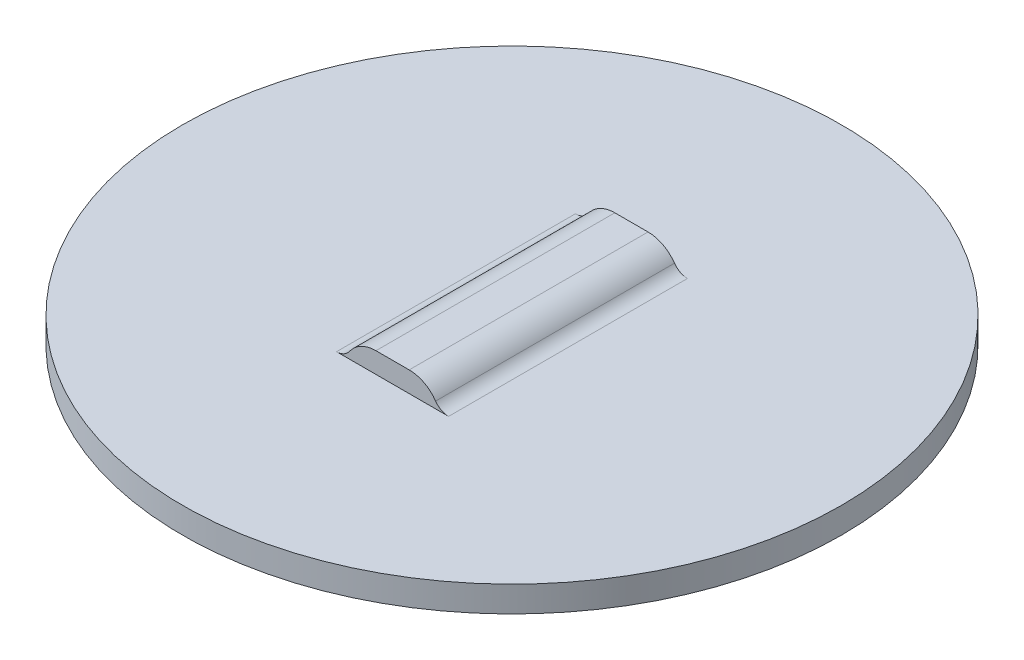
ISO-10303-21;
HEADER;
FILE_DESCRIPTION(('STEP AP214'),'2;1');
FILE_NAME('part.step','',(''),(''),'','','');
FILE_SCHEMA(('AUTOMOTIVE_DESIGN { 1 0 10303 214 1 1 1 1 }'));
ENDSEC;
DATA;
#1=APPLICATION_CONTEXT('core data for automotive mechanical design processes');
#2=APPLICATION_PROTOCOL_DEFINITION('international standard','automotive_design',2000,#1);
#3=PRODUCT_CONTEXT('',#1,'mechanical');
#4=PRODUCT('Part','Part','',(#3));
#5=PRODUCT_RELATED_PRODUCT_CATEGORY('part','',(#4));
#6=PRODUCT_DEFINITION_FORMATION('','',#4);
#7=PRODUCT_DEFINITION_CONTEXT('part definition',#1,'design');
#8=PRODUCT_DEFINITION('design','',#6,#7);
#9=PRODUCT_DEFINITION_SHAPE('','',#8);
#10=(LENGTH_UNIT() NAMED_UNIT(*) SI_UNIT(.MILLI.,.METRE.));
#11=(NAMED_UNIT(*) PLANE_ANGLE_UNIT() SI_UNIT($,.RADIAN.));
#12=(NAMED_UNIT(*) SI_UNIT($,.STERADIAN.) SOLID_ANGLE_UNIT());
#13=UNCERTAINTY_MEASURE_WITH_UNIT(LENGTH_MEASURE(1.E-05),#10,'distance_accuracy_value','');
#14=(GEOMETRIC_REPRESENTATION_CONTEXT(3) GLOBAL_UNCERTAINTY_ASSIGNED_CONTEXT((#13)) GLOBAL_UNIT_ASSIGNED_CONTEXT((#10,
#11,#12)) REPRESENTATION_CONTEXT('',''));
#15=CARTESIAN_POINT('',(0.,0.,0.));
#16=DIRECTION('',(0.,0.,1.));
#17=DIRECTION('',(1.,0.,0.));
#18=AXIS2_PLACEMENT_3D('',#15,#16,#17);
#19=CARTESIAN_POINT('',(-0.8001,-0.562707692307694,11.5062));
#20=DIRECTION('',(0.,0.,-1.));
#21=DIRECTION('',(-1.,0.,0.));
#22=AXIS2_PLACEMENT_3D('',#19,#20,#21);
#23=CYLINDRICAL_SURFACE('',#22,0.308707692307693);
#24=DIRECTION('',(0.,0.,1.));
#25=VECTOR('',#24,1.);
#26=CARTESIAN_POINT('',(-0.8001,-0.254,11.5062));
#27=LINE('',#26,#25);
#28=CARTESIAN_POINT('',(-0.8001,-0.254,11.5062));
#29=VERTEX_POINT('',#28);
#30=CARTESIAN_POINT('',(-0.8001,-0.254,0.));
#31=VERTEX_POINT('',#30);
#32=EDGE_CURVE('E129',#29,#31,#27,.F.);
#33=ORIENTED_EDGE('',*,*,#32,.F.);
#34=CARTESIAN_POINT('',(-0.8001,-0.562707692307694,11.5062));
#35=DIRECTION('',(0.,0.,-1.));
#36=DIRECTION('',(-1.,0.,0.));
#37=AXIS2_PLACEMENT_3D('',#34,#35,#36);
#38=CIRCLE('',#37,0.308707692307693);
#39=CARTESIAN_POINT('',(-1.05328589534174,-0.38608,11.5062));
#40=VERTEX_POINT('',#39);
#41=EDGE_CURVE('E119',#40,#29,#38,.T.);
#42=ORIENTED_EDGE('',*,*,#41,.F.);
#43=DIRECTION('',(0.,0.,-1.));
#44=VECTOR('',#43,1.);
#45=CARTESIAN_POINT('',(-1.05328589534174,-0.38608,11.5062));
#46=LINE('',#45,#44);
#47=CARTESIAN_POINT('',(-1.05328589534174,-0.38608,0.));
#48=VERTEX_POINT('',#47);
#49=EDGE_CURVE('E113',#48,#40,#46,.F.);
#50=ORIENTED_EDGE('',*,*,#49,.F.);
#51=CARTESIAN_POINT('',(-0.8001,-0.562707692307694,0.));
#52=DIRECTION('',(0.,0.,-1.));
#53=DIRECTION('',(-1.,0.,0.));
#54=AXIS2_PLACEMENT_3D('',#51,#52,#53);
#55=CIRCLE('',#54,0.308707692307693);
#56=EDGE_CURVE('E21',#48,#31,#55,.T.);
#57=ORIENTED_EDGE('',*,*,#56,.T.);
#58=EDGE_LOOP('',(#33,#42,#50,#57));
#59=FACE_BOUND('',#58,.T.);
#60=ADVANCED_FACE('F18',(#59),#23,.F.);
#61=CARTESIAN_POINT('',(-0.8001,-0.254,11.5062));
#62=DIRECTION('',(0.,-1.,0.));
#63=DIRECTION('',(1.,0.,0.));
#64=AXIS2_PLACEMENT_3D('',#61,#62,#63);
#65=PLANE('',#64);
#66=DIRECTION('',(-1.,0.,0.));
#67=VECTOR('',#66,1.);
#68=CARTESIAN_POINT('',(-2.69899421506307,-0.254,11.5062));
#69=LINE('',#68,#67);
#70=CARTESIAN_POINT('',(0.8001,-0.254,11.5062));
#71=VERTEX_POINT('',#70);
#72=EDGE_CURVE('E121',#29,#71,#69,.F.);
#73=ORIENTED_EDGE('',*,*,#72,.F.);
#74=ORIENTED_EDGE('',*,*,#32,.T.);
#75=DIRECTION('',(-1.,0.,0.));
#76=VECTOR('',#75,1.);
#77=CARTESIAN_POINT('',(-15.875,-0.254,0.));
#78=LINE('',#77,#76);
#79=CARTESIAN_POINT('',(0.8001,-0.254,0.));
#80=VERTEX_POINT('',#79);
#81=EDGE_CURVE('E105',#31,#80,#78,.F.);
#82=ORIENTED_EDGE('',*,*,#81,.T.);
#83=DIRECTION('',(0.,0.,-1.));
#84=VECTOR('',#83,1.);
#85=CARTESIAN_POINT('',(0.8001,-0.254,11.5062));
#86=LINE('',#85,#84);
#87=EDGE_CURVE('E109',#80,#71,#86,.F.);
#88=ORIENTED_EDGE('',*,*,#87,.T.);
#89=EDGE_LOOP('',(#73,#74,#82,#88));
#90=FACE_BOUND('',#89,.T.);
#91=ADVANCED_FACE('F365',(#90),#65,.T.);
#92=CARTESIAN_POINT('',(0.8001,-0.562707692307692,11.5062));
#93=DIRECTION('',(0.,0.,-1.));
#94=DIRECTION('',(-1.,0.,0.));
#95=AXIS2_PLACEMENT_3D('',#92,#93,#94);
#96=CYLINDRICAL_SURFACE('',#95,0.308707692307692);
#97=ORIENTED_EDGE('',*,*,#87,.F.);
#98=CARTESIAN_POINT('',(0.8001,-0.562707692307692,0.));
#99=DIRECTION('',(0.,0.,-1.));
#100=DIRECTION('',(-1.,0.,0.));
#101=AXIS2_PLACEMENT_3D('',#98,#99,#100);
#102=CIRCLE('',#101,0.308707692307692);
#103=CARTESIAN_POINT('',(1.05328589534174,-0.386080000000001,0.));
#104=VERTEX_POINT('',#103);
#105=EDGE_CURVE('E116',#80,#104,#102,.T.);
#106=ORIENTED_EDGE('',*,*,#105,.T.);
#107=DIRECTION('',(0.,0.,-1.));
#108=VECTOR('',#107,1.);
#109=CARTESIAN_POINT('',(1.05328589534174,-0.386080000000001,11.5062));
#110=LINE('',#109,#108);
#111=CARTESIAN_POINT('',(1.05328589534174,-0.386080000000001,11.5062));
#112=VERTEX_POINT('',#111);
#113=EDGE_CURVE('E125',#112,#104,#110,.T.);
#114=ORIENTED_EDGE('',*,*,#113,.F.);
#115=CARTESIAN_POINT('',(0.8001,-0.562707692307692,11.5062));
#116=DIRECTION('',(0.,0.,-1.));
#117=DIRECTION('',(-1.,0.,0.));
#118=AXIS2_PLACEMENT_3D('',#115,#116,#117);
#119=CIRCLE('',#118,0.308707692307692);
#120=EDGE_CURVE('E170',#71,#112,#119,.T.);
#121=ORIENTED_EDGE('',*,*,#120,.F.);
#122=EDGE_LOOP('',(#97,#106,#114,#121));
#123=FACE_BOUND('',#122,.T.);
#124=ADVANCED_FACE('F357',(#123),#96,.F.);
#125=CARTESIAN_POINT('',(-15.875,0.,0.));
#126=DIRECTION('',(0.,0.,-1.));
#127=DIRECTION('',(-1.,0.,0.));
#128=AXIS2_PLACEMENT_3D('',#125,#126,#127);
#129=PLANE('',#128);
#130=ORIENTED_EDGE('',*,*,#81,.F.);
#131=ORIENTED_EDGE('',*,*,#56,.F.);
#132=CARTESIAN_POINT('',(-2.69899421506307,0.762,0.));
#133=DIRECTION('',(0.,0.,-1.));
#134=DIRECTION('',(-1.,0.,0.));
#135=AXIS2_PLACEMENT_3D('',#132,#133,#134);
#136=CIRCLE('',#135,2.0066);
#137=CARTESIAN_POINT('',(-2.69899421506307,-1.2446,0.));
#138=VERTEX_POINT('',#137);
#139=EDGE_CURVE('E101',#138,#48,#136,.F.);
#140=ORIENTED_EDGE('',*,*,#139,.F.);
#141=DIRECTION('',(1.,0.,0.));
#142=VECTOR('',#141,1.);
#143=CARTESIAN_POINT('',(2.2479,-1.2446,0.));
#144=LINE('',#143,#142);
#145=CARTESIAN_POINT('',(2.69899421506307,-1.2446,0.));
#146=VERTEX_POINT('',#145);
#147=EDGE_CURVE('E177',#146,#138,#144,.F.);
#148=ORIENTED_EDGE('',*,*,#147,.F.);
#149=CARTESIAN_POINT('',(2.69899421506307,0.761999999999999,0.));
#150=DIRECTION('',(0.,0.,-1.));
#151=DIRECTION('',(-1.,0.,0.));
#152=AXIS2_PLACEMENT_3D('',#149,#150,#151);
#153=CIRCLE('',#152,2.0066);
#154=EDGE_CURVE('E162',#104,#146,#153,.F.);
#155=ORIENTED_EDGE('',*,*,#154,.F.);
#156=ORIENTED_EDGE('',*,*,#105,.F.);
#157=EDGE_LOOP('',(#130,#131,#140,#148,#155,#156));
#158=FACE_BOUND('',#157,.T.);
#159=ADVANCED_FACE('F99',(#158),#129,.F.);
#160=CARTESIAN_POINT('',(-2.69899421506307,0.762,11.5062));
#161=DIRECTION('',(0.,0.,-1.));
#162=DIRECTION('',(-1.,0.,0.));
#163=AXIS2_PLACEMENT_3D('',#160,#161,#162);
#164=CYLINDRICAL_SURFACE('',#163,2.0066);
#165=ORIENTED_EDGE('',*,*,#139,.T.);
#166=ORIENTED_EDGE('',*,*,#49,.T.);
#167=CARTESIAN_POINT('',(-2.69899421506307,0.762,11.5062));
#168=DIRECTION('',(0.,0.,-1.));
#169=DIRECTION('',(-1.,0.,0.));
#170=AXIS2_PLACEMENT_3D('',#167,#168,#169);
#171=CIRCLE('',#170,2.0066);
#172=CARTESIAN_POINT('',(-2.69899421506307,-1.2446,11.5062));
#173=VERTEX_POINT('',#172);
#174=EDGE_CURVE('E168',#173,#40,#171,.F.);
#175=ORIENTED_EDGE('',*,*,#174,.F.);
#176=DIRECTION('',(0.,0.,1.));
#177=VECTOR('',#176,1.);
#178=CARTESIAN_POINT('',(-2.69899421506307,-1.2446,11.5062));
#179=LINE('',#178,#177);
#180=EDGE_CURVE('E115',#138,#173,#179,.T.);
#181=ORIENTED_EDGE('',*,*,#180,.F.);
#182=EDGE_LOOP('',(#165,#166,#175,#181));
#183=FACE_BOUND('',#182,.T.);
#184=ADVANCED_FACE('F111',(#183),#164,.T.);
#185=CARTESIAN_POINT('',(-2.69899421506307,0.,11.5062));
#186=DIRECTION('',(0.,0.,-1.));
#187=DIRECTION('',(-1.,0.,0.));
#188=AXIS2_PLACEMENT_3D('',#185,#186,#187);
#189=PLANE('',#188);
#190=DIRECTION('',(1.,0.,0.));
#191=VECTOR('',#190,1.);
#192=CARTESIAN_POINT('',(2.2479,-1.2446,11.5062));
#193=LINE('',#192,#191);
#194=CARTESIAN_POINT('',(2.69899421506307,-1.2446,11.5062));
#195=VERTEX_POINT('',#194);
#196=EDGE_CURVE('E183',#173,#195,#193,.T.);
#197=ORIENTED_EDGE('',*,*,#196,.F.);
#198=ORIENTED_EDGE('',*,*,#174,.T.);
#199=ORIENTED_EDGE('',*,*,#41,.T.);
#200=ORIENTED_EDGE('',*,*,#72,.T.);
#201=ORIENTED_EDGE('',*,*,#120,.T.);
#202=CARTESIAN_POINT('',(2.69899421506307,0.761999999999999,11.5062));
#203=DIRECTION('',(0.,0.,-1.));
#204=DIRECTION('',(-1.,0.,0.));
#205=AXIS2_PLACEMENT_3D('',#202,#203,#204);
#206=CIRCLE('',#205,2.0066);
#207=EDGE_CURVE('E165',#195,#112,#206,.T.);
#208=ORIENTED_EDGE('',*,*,#207,.F.);
#209=EDGE_LOOP('',(#197,#198,#199,#200,#201,#208));
#210=FACE_BOUND('',#209,.T.);
#211=ADVANCED_FACE('F333',(#210),#189,.T.);
#212=CARTESIAN_POINT('',(2.69899421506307,0.761999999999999,11.5062));
#213=DIRECTION('',(0.,0.,-1.));
#214=DIRECTION('',(-1.,0.,0.));
#215=AXIS2_PLACEMENT_3D('',#212,#213,#214);
#216=CYLINDRICAL_SURFACE('',#215,2.0066);
#217=ORIENTED_EDGE('',*,*,#154,.T.);
#218=DIRECTION('',(0.,0.,1.));
#219=VECTOR('',#218,1.);
#220=CARTESIAN_POINT('',(2.69899421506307,-1.2446,11.5062));
#221=LINE('',#220,#219);
#222=EDGE_CURVE('E180',#195,#146,#221,.F.);
#223=ORIENTED_EDGE('',*,*,#222,.F.);
#224=ORIENTED_EDGE('',*,*,#207,.T.);
#225=ORIENTED_EDGE('',*,*,#113,.T.);
#226=EDGE_LOOP('',(#217,#223,#224,#225));
#227=FACE_BOUND('',#226,.T.);
#228=ADVANCED_FACE('F325',(#227),#216,.T.);
#229=CARTESIAN_POINT('',(0.8001,-0.562707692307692,11.5062));
#230=DIRECTION('',(0.,0.,-1.));
#231=DIRECTION('',(-1.,0.,0.));
#232=AXIS2_PLACEMENT_3D('',#229,#230,#231);
#233=CYLINDRICAL_SURFACE('',#232,1.55330769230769);
#234=CARTESIAN_POINT('',(0.8001,-0.562707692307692,0.));
#235=DIRECTION('',(0.,0.,-1.));
#236=DIRECTION('',(-1.,0.,0.));
#237=AXIS2_PLACEMENT_3D('',#234,#235,#236);
#238=CIRCLE('',#237,1.55330769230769);
#239=CARTESIAN_POINT('',(2.07404168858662,0.326020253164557,0.));
#240=VERTEX_POINT('',#239);
#241=CARTESIAN_POINT('',(0.8001,0.9906,0.));
#242=VERTEX_POINT('',#241);
#243=EDGE_CURVE('E143',#240,#242,#238,.F.);
#244=ORIENTED_EDGE('',*,*,#243,.T.);
#245=DIRECTION('',(0.,0.,1.));
#246=VECTOR('',#245,1.);
#247=CARTESIAN_POINT('',(0.8001,0.9906,11.5062));
#248=LINE('',#247,#246);
#249=CARTESIAN_POINT('',(0.8001,0.9906,11.5062));
#250=VERTEX_POINT('',#249);
#251=EDGE_CURVE('E164',#242,#250,#248,.T.);
#252=ORIENTED_EDGE('',*,*,#251,.T.);
#253=CARTESIAN_POINT('',(0.8001,-0.562707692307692,11.5062));
#254=DIRECTION('',(0.,0.,-1.));
#255=DIRECTION('',(-1.,0.,0.));
#256=AXIS2_PLACEMENT_3D('',#253,#254,#255);
#257=CIRCLE('',#256,1.55330769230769);
#258=CARTESIAN_POINT('',(2.07404168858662,0.326020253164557,11.5062));
#259=VERTEX_POINT('',#258);
#260=EDGE_CURVE('E151',#250,#259,#257,.T.);
#261=ORIENTED_EDGE('',*,*,#260,.T.);
#262=DIRECTION('',(0.,0.,-1.));
#263=VECTOR('',#262,1.);
#264=CARTESIAN_POINT('',(2.07404168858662,0.326020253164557,11.5062));
#265=LINE('',#264,#263);
#266=EDGE_CURVE('E150',#259,#240,#265,.T.);
#267=ORIENTED_EDGE('',*,*,#266,.T.);
#268=EDGE_LOOP('',(#244,#252,#261,#267));
#269=FACE_BOUND('',#268,.T.);
#270=ADVANCED_FACE('F216',(#269),#233,.T.);
#271=CARTESIAN_POINT('',(-0.8001,0.9906,11.5062));
#272=DIRECTION('',(0.,-1.,0.));
#273=DIRECTION('',(1.,0.,0.));
#274=AXIS2_PLACEMENT_3D('',#271,#272,#273);
#275=PLANE('',#274);
#276=DIRECTION('',(0.,0.,-1.));
#277=VECTOR('',#276,1.);
#278=CARTESIAN_POINT('',(-0.8001,0.9906,11.5062));
#279=LINE('',#278,#277);
#280=CARTESIAN_POINT('',(-0.8001,0.9906,11.5062));
#281=VERTEX_POINT('',#280);
#282=CARTESIAN_POINT('',(-0.8001,0.9906,0.));
#283=VERTEX_POINT('',#282);
#284=EDGE_CURVE('E179',#281,#283,#279,.T.);
#285=ORIENTED_EDGE('',*,*,#284,.F.);
#286=DIRECTION('',(-1.,0.,0.));
#287=VECTOR('',#286,1.);
#288=CARTESIAN_POINT('',(-0.8001,0.9906,11.5062));
#289=LINE('',#288,#287);
#290=EDGE_CURVE('E154',#281,#250,#289,.F.);
#291=ORIENTED_EDGE('',*,*,#290,.T.);
#292=ORIENTED_EDGE('',*,*,#251,.F.);
#293=DIRECTION('',(1.,0.,0.));
#294=VECTOR('',#293,1.);
#295=CARTESIAN_POINT('',(-2.69899421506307,0.9906,0.));
#296=LINE('',#295,#294);
#297=EDGE_CURVE('E142',#242,#283,#296,.F.);
#298=ORIENTED_EDGE('',*,*,#297,.T.);
#299=EDGE_LOOP('',(#285,#291,#292,#298));
#300=FACE_BOUND('',#299,.T.);
#301=ADVANCED_FACE('F208',(#300),#275,.F.);
#302=CARTESIAN_POINT('',(-0.8001,-0.562707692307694,11.5062));
#303=DIRECTION('',(0.,0.,-1.));
#304=DIRECTION('',(-1.,0.,0.));
#305=AXIS2_PLACEMENT_3D('',#302,#303,#304);
#306=CYLINDRICAL_SURFACE('',#305,1.55330769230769);
#307=CARTESIAN_POINT('',(-0.8001,-0.562707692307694,11.5062));
#308=DIRECTION('',(0.,0.,-1.));
#309=DIRECTION('',(-1.,0.,0.));
#310=AXIS2_PLACEMENT_3D('',#307,#308,#309);
#311=CIRCLE('',#310,1.55330769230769);
#312=CARTESIAN_POINT('',(-2.07404168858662,0.326020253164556,11.5062));
#313=VERTEX_POINT('',#312);
#314=EDGE_CURVE('E155',#313,#281,#311,.T.);
#315=ORIENTED_EDGE('',*,*,#314,.T.);
#316=ORIENTED_EDGE('',*,*,#284,.T.);
#317=CARTESIAN_POINT('',(-0.8001,-0.562707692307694,0.));
#318=DIRECTION('',(0.,0.,-1.));
#319=DIRECTION('',(-1.,0.,0.));
#320=AXIS2_PLACEMENT_3D('',#317,#318,#319);
#321=CIRCLE('',#320,1.55330769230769);
#322=CARTESIAN_POINT('',(-2.07404168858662,0.326020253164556,0.));
#323=VERTEX_POINT('',#322);
#324=EDGE_CURVE('E139',#283,#323,#321,.F.);
#325=ORIENTED_EDGE('',*,*,#324,.T.);
#326=DIRECTION('',(0.,0.,-1.));
#327=VECTOR('',#326,1.);
#328=CARTESIAN_POINT('',(-2.07404168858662,0.326020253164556,11.5062));
#329=LINE('',#328,#327);
#330=EDGE_CURVE('E161',#323,#313,#329,.F.);
#331=ORIENTED_EDGE('',*,*,#330,.T.);
#332=EDGE_LOOP('',(#315,#316,#325,#331));
#333=FACE_BOUND('',#332,.T.);
#334=ADVANCED_FACE('F233',(#333),#306,.T.);
#335=CARTESIAN_POINT('',(2.2479,-1.2446,11.5062));
#336=DIRECTION('',(0.,-1.,0.));
#337=DIRECTION('',(1.,0.,0.));
#338=AXIS2_PLACEMENT_3D('',#335,#336,#337);
#339=PLANE('',#338);
#340=CARTESIAN_POINT('',(0.,-1.2446,5.7531));
#341=DIRECTION('',(0.,-1.,0.));
#342=DIRECTION('',(1.,0.,0.));
#343=AXIS2_PLACEMENT_3D('',#340,#341,#342);
#344=CIRCLE('',#343,15.875);
#345=CARTESIAN_POINT('',(15.875,-1.2446,5.7531));
#346=VERTEX_POINT('',#345);
#347=EDGE_CURVE('E132',#346,#346,#344,.F.);
#348=ORIENTED_EDGE('',*,*,#347,.F.);
#349=EDGE_LOOP('',(#348));
#350=FACE_BOUND('',#349,.T.);
#351=ORIENTED_EDGE('',*,*,#196,.T.);
#352=ORIENTED_EDGE('',*,*,#222,.T.);
#353=ORIENTED_EDGE('',*,*,#147,.T.);
#354=ORIENTED_EDGE('',*,*,#180,.T.);
#355=EDGE_LOOP('',(#351,#352,#353,#354));
#356=FACE_BOUND('',#355,.T.);
#357=ADVANCED_FACE('F235',(#350,#356),#339,.T.);
#358=CARTESIAN_POINT('',(-2.69899421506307,0.762,11.5062));
#359=DIRECTION('',(0.,0.,-1.));
#360=DIRECTION('',(-1.,0.,0.));
#361=AXIS2_PLACEMENT_3D('',#358,#359,#360);
#362=CYLINDRICAL_SURFACE('',#361,0.762);
#363=ORIENTED_EDGE('',*,*,#330,.F.);
#364=CARTESIAN_POINT('',(-2.69899421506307,0.762,0.));
#365=DIRECTION('',(0.,0.,-1.));
#366=DIRECTION('',(-1.,0.,0.));
#367=AXIS2_PLACEMENT_3D('',#364,#365,#366);
#368=CIRCLE('',#367,0.762);
#369=CARTESIAN_POINT('',(-2.69899421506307,0.,0.));
#370=VERTEX_POINT('',#369);
#371=EDGE_CURVE('E136',#323,#370,#368,.T.);
#372=ORIENTED_EDGE('',*,*,#371,.T.);
#373=DIRECTION('',(0.,0.,1.));
#374=VECTOR('',#373,1.);
#375=CARTESIAN_POINT('',(-2.69899421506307,0.,11.5062));
#376=LINE('',#375,#374);
#377=CARTESIAN_POINT('',(-2.69899421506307,0.,11.5062));
#378=VERTEX_POINT('',#377);
#379=EDGE_CURVE('E135',#370,#378,#376,.T.);
#380=ORIENTED_EDGE('',*,*,#379,.T.);
#381=CARTESIAN_POINT('',(-2.69899421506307,0.762,11.5062));
#382=DIRECTION('',(0.,0.,-1.));
#383=DIRECTION('',(-1.,0.,0.));
#384=AXIS2_PLACEMENT_3D('',#381,#382,#383);
#385=CIRCLE('',#384,0.762);
#386=EDGE_CURVE('E158',#378,#313,#385,.F.);
#387=ORIENTED_EDGE('',*,*,#386,.T.);
#388=EDGE_LOOP('',(#363,#372,#380,#387));
#389=FACE_BOUND('',#388,.T.);
#390=ADVANCED_FACE('F230',(#389),#362,.F.);
#391=CARTESIAN_POINT('',(-0.8001,-0.562707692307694,11.5062));
#392=DIRECTION('',(0.,0.,-1.));
#393=DIRECTION('',(-1.,0.,0.));
#394=AXIS2_PLACEMENT_3D('',#391,#392,#393);
#395=PLANE('',#394);
#396=CARTESIAN_POINT('',(2.69899421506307,0.761999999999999,11.5062));
#397=DIRECTION('',(0.,0.,-1.));
#398=DIRECTION('',(-1.,0.,0.));
#399=AXIS2_PLACEMENT_3D('',#396,#397,#398);
#400=CIRCLE('',#399,0.762);
#401=CARTESIAN_POINT('',(2.69899421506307,0.,11.5062));
#402=VERTEX_POINT('',#401);
#403=EDGE_CURVE('E147',#402,#259,#400,.T.);
#404=ORIENTED_EDGE('',*,*,#403,.T.);
#405=ORIENTED_EDGE('',*,*,#260,.F.);
#406=ORIENTED_EDGE('',*,*,#290,.F.);
#407=ORIENTED_EDGE('',*,*,#314,.F.);
#408=ORIENTED_EDGE('',*,*,#386,.F.);
#409=DIRECTION('',(1.,0.,0.));
#410=VECTOR('',#409,1.);
#411=CARTESIAN_POINT('',(2.2479,0.,11.5062));
#412=LINE('',#411,#410);
#413=EDGE_CURVE('E194',#378,#402,#412,.T.);
#414=ORIENTED_EDGE('',*,*,#413,.T.);
#415=EDGE_LOOP('',(#404,#405,#406,#407,#408,#414));
#416=FACE_BOUND('',#415,.T.);
#417=ADVANCED_FACE('F226',(#416),#395,.F.);
#418=CARTESIAN_POINT('',(2.69899421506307,0.761999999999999,11.5062));
#419=DIRECTION('',(0.,0.,-1.));
#420=DIRECTION('',(-1.,0.,0.));
#421=AXIS2_PLACEMENT_3D('',#418,#419,#420);
#422=CYLINDRICAL_SURFACE('',#421,0.762);
#423=DIRECTION('',(0.,0.,1.));
#424=VECTOR('',#423,1.);
#425=CARTESIAN_POINT('',(2.69899421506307,0.,11.5062));
#426=LINE('',#425,#424);
#427=CARTESIAN_POINT('',(2.69899421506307,0.,0.));
#428=VERTEX_POINT('',#427);
#429=EDGE_CURVE('E197',#402,#428,#426,.F.);
#430=ORIENTED_EDGE('',*,*,#429,.T.);
#431=CARTESIAN_POINT('',(2.69899421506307,0.761999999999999,0.));
#432=DIRECTION('',(0.,0.,-1.));
#433=DIRECTION('',(-1.,0.,0.));
#434=AXIS2_PLACEMENT_3D('',#431,#432,#433);
#435=CIRCLE('',#434,0.762);
#436=EDGE_CURVE('E36',#428,#240,#435,.T.);
#437=ORIENTED_EDGE('',*,*,#436,.T.);
#438=ORIENTED_EDGE('',*,*,#266,.F.);
#439=ORIENTED_EDGE('',*,*,#403,.F.);
#440=EDGE_LOOP('',(#430,#437,#438,#439));
#441=FACE_BOUND('',#440,.T.);
#442=ADVANCED_FACE('F219',(#441),#422,.F.);
#443=CARTESIAN_POINT('',(-2.69899421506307,0.762,0.));
#444=DIRECTION('',(0.,0.,1.));
#445=DIRECTION('',(1.,0.,0.));
#446=AXIS2_PLACEMENT_3D('',#443,#444,#445);
#447=PLANE('',#446);
#448=ORIENTED_EDGE('',*,*,#371,.F.);
#449=ORIENTED_EDGE('',*,*,#324,.F.);
#450=ORIENTED_EDGE('',*,*,#297,.F.);
#451=ORIENTED_EDGE('',*,*,#243,.F.);
#452=ORIENTED_EDGE('',*,*,#436,.F.);
#453=DIRECTION('',(1.,0.,0.));
#454=VECTOR('',#453,1.);
#455=CARTESIAN_POINT('',(2.2479,0.,0.));
#456=LINE('',#455,#454);
#457=EDGE_CURVE('E27',#428,#370,#456,.F.);
#458=ORIENTED_EDGE('',*,*,#457,.T.);
#459=EDGE_LOOP('',(#448,#449,#450,#451,#452,#458));
#460=FACE_BOUND('',#459,.T.);
#461=ADVANCED_FACE('F214',(#460),#447,.F.);
#462=CARTESIAN_POINT('',(0.,0.,5.7531));
#463=DIRECTION('',(0.,-1.,0.));
#464=DIRECTION('',(1.,0.,0.));
#465=AXIS2_PLACEMENT_3D('',#462,#463,#464);
#466=CYLINDRICAL_SURFACE('',#465,15.875);
#467=ORIENTED_EDGE('',*,*,#347,.T.);
#468=EDGE_LOOP('',(#467));
#469=FACE_BOUND('',#468,.T.);
#470=CARTESIAN_POINT('',(0.,0.,5.7531));
#471=DIRECTION('',(0.,-1.,0.));
#472=DIRECTION('',(1.,0.,0.));
#473=AXIS2_PLACEMENT_3D('',#470,#471,#472);
#474=CIRCLE('',#473,15.875);
#475=CARTESIAN_POINT('',(15.875,0.,5.7531));
#476=VERTEX_POINT('',#475);
#477=EDGE_CURVE('E11',#476,#476,#474,.T.);
#478=ORIENTED_EDGE('',*,*,#477,.T.);
#479=EDGE_LOOP('',(#478));
#480=FACE_BOUND('',#479,.T.);
#481=ADVANCED_FACE('F246',(#469,#480),#466,.T.);
#482=CARTESIAN_POINT('',(2.2479,0.,11.5062));
#483=DIRECTION('',(0.,-1.,0.));
#484=DIRECTION('',(1.,0.,0.));
#485=AXIS2_PLACEMENT_3D('',#482,#483,#484);
#486=PLANE('',#485);
#487=ORIENTED_EDGE('',*,*,#477,.F.);
#488=EDGE_LOOP('',(#487));
#489=FACE_BOUND('',#488,.T.);
#490=ORIENTED_EDGE('',*,*,#429,.F.);
#491=ORIENTED_EDGE('',*,*,#413,.F.);
#492=ORIENTED_EDGE('',*,*,#379,.F.);
#493=ORIENTED_EDGE('',*,*,#457,.F.);
#494=EDGE_LOOP('',(#490,#491,#492,#493));
#495=FACE_BOUND('',#494,.T.);
#496=ADVANCED_FACE('F223',(#489,#495),#486,.F.);
#497=CLOSED_SHELL('',(#60,#91,#124,#159,#184,#211,#228,#270,#301,#334,#357,#390,#417,#442,#461,
#481,#496));
#498=MANIFOLD_SOLID_BREP('B1',#497);
#499=ADVANCED_BREP_SHAPE_REPRESENTATION('',(#18,#498),#14);
#500=SHAPE_DEFINITION_REPRESENTATION(#9,#499);
ENDSEC;
END-ISO-10303-21;
